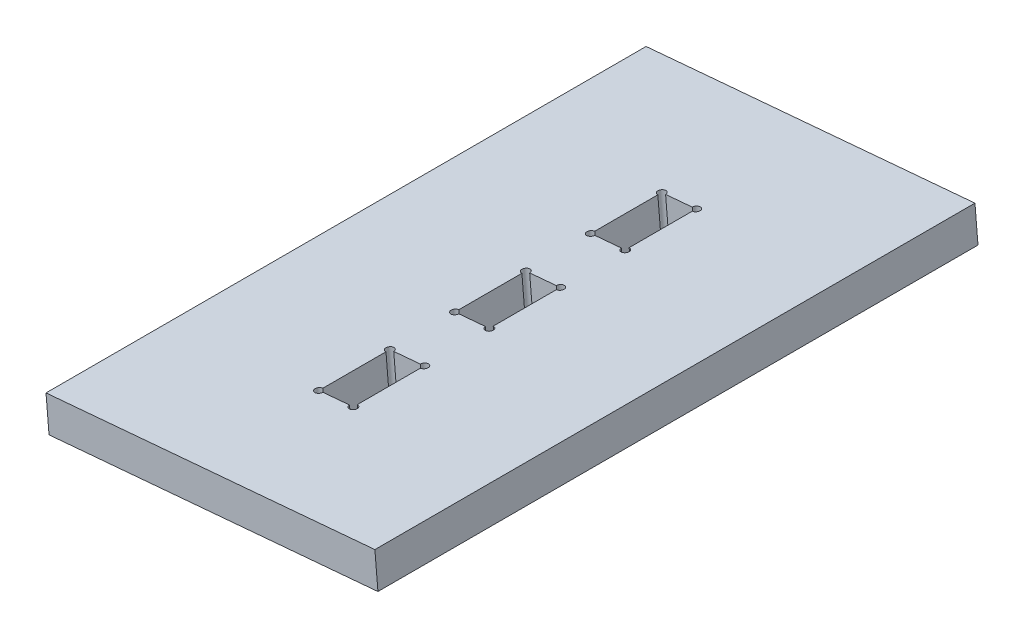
ISO-10303-21;
HEADER;
FILE_DESCRIPTION(('STEP AP214'),'2;1');
FILE_NAME('part.step','',(''),(''),'','','');
FILE_SCHEMA(('AUTOMOTIVE_DESIGN { 1 0 10303 214 1 1 1 1 }'));
ENDSEC;
DATA;
#1=APPLICATION_CONTEXT('core data for automotive mechanical design processes');
#2=APPLICATION_PROTOCOL_DEFINITION('international standard','automotive_design',2000,#1);
#3=PRODUCT_CONTEXT('',#1,'mechanical');
#4=PRODUCT('Part','Part','',(#3));
#5=PRODUCT_RELATED_PRODUCT_CATEGORY('part','',(#4));
#6=PRODUCT_DEFINITION_FORMATION('','',#4);
#7=PRODUCT_DEFINITION_CONTEXT('part definition',#1,'design');
#8=PRODUCT_DEFINITION('design','',#6,#7);
#9=PRODUCT_DEFINITION_SHAPE('','',#8);
#10=(LENGTH_UNIT() NAMED_UNIT(*) SI_UNIT(.MILLI.,.METRE.));
#11=(NAMED_UNIT(*) PLANE_ANGLE_UNIT() SI_UNIT($,.RADIAN.));
#12=(NAMED_UNIT(*) SI_UNIT($,.STERADIAN.) SOLID_ANGLE_UNIT());
#13=UNCERTAINTY_MEASURE_WITH_UNIT(LENGTH_MEASURE(1.E-05),#10,'distance_accuracy_value','');
#14=(GEOMETRIC_REPRESENTATION_CONTEXT(3) GLOBAL_UNCERTAINTY_ASSIGNED_CONTEXT((#13)) GLOBAL_UNIT_ASSIGNED_CONTEXT((#10,
#11,#12)) REPRESENTATION_CONTEXT('',''));
#15=CARTESIAN_POINT('',(0.,0.,0.));
#16=DIRECTION('',(0.,0.,1.));
#17=DIRECTION('',(1.,0.,0.));
#18=AXIS2_PLACEMENT_3D('',#15,#16,#17);
#19=CARTESIAN_POINT('',(138.934622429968,1.61861859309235,-182.268357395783));
#20=DIRECTION('',(0.,0.,-1.));
#21=DIRECTION('',(-1.,0.,0.));
#22=AXIS2_PLACEMENT_3D('',#19,#20,#21);
#23=PLANE('',#22);
#24=DIRECTION('',(-0.996194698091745,-0.0871557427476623,0.));
#25=VECTOR('',#24,1.);
#26=CARTESIAN_POINT('',(136.079297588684,34.2551308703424,-182.268357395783));
#27=LINE('',#26,#25);
#28=CARTESIAN_POINT('',(151.819173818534,35.6321916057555,-182.268357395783));
#29=VERTEX_POINT('',#28);
#30=CARTESIAN_POINT('',(138.071686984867,34.4294423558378,-182.268357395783));
#31=VERTEX_POINT('',#30);
#32=EDGE_CURVE('E11',#29,#31,#27,.T.);
#33=ORIENTED_EDGE('',*,*,#32,.T.);
#34=DIRECTION('',(-0.0871557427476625,0.996194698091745,0.));
#35=VECTOR('',#34,1.);
#36=CARTESIAN_POINT('',(140.927011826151,1.79293007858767,-182.268357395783));
#37=LINE('',#36,#35);
#38=CARTESIAN_POINT('',(139.640490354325,16.4979377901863,-182.268357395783));
#39=VERTEX_POINT('',#38);
#40=EDGE_CURVE('E415',#39,#31,#37,.T.);
#41=ORIENTED_EDGE('',*,*,#40,.F.);
#42=DIRECTION('',(0.996194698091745,0.0871557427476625,0.));
#43=VECTOR('',#42,1.);
#44=CARTESIAN_POINT('',(137.648100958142,16.323626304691,-182.268357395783));
#45=LINE('',#44,#43);
#46=CARTESIAN_POINT('',(153.387977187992,17.7006870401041,-182.268357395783));
#47=VERTEX_POINT('',#46);
#48=EDGE_CURVE('E407',#39,#47,#45,.T.);
#49=ORIENTED_EDGE('',*,*,#48,.T.);
#50=DIRECTION('',(-0.0871557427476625,0.996194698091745,0.));
#51=VECTOR('',#50,1.);
#52=CARTESIAN_POINT('',(154.674498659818,2.99567932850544,-182.268357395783));
#53=LINE('',#52,#51);
#54=EDGE_CURVE('E321',#29,#47,#53,.F.);
#55=ORIENTED_EDGE('',*,*,#54,.F.);
#56=EDGE_LOOP('',(#33,#41,#49,#55));
#57=FACE_BOUND('',#56,.T.);
#58=ADVANCED_FACE('F33',(#57),#23,.F.);
#59=CARTESIAN_POINT('',(138.934622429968,1.61861859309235,-182.268357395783));
#60=DIRECTION('',(-0.996194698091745,-0.0871557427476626,0.));
#61=DIRECTION('',(0.0871557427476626,-0.996194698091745,0.));
#62=AXIS2_PLACEMENT_3D('',#59,#60,#61);
#63=PLANE('',#62);
#64=DIRECTION('',(0.,0.,1.));
#65=VECTOR('',#64,1.);
#66=CARTESIAN_POINT('',(136.079297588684,34.2551308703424,-182.268357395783));
#67=LINE('',#66,#65);
#68=CARTESIAN_POINT('',(136.079297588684,34.2551308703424,-180.268357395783));
#69=VERTEX_POINT('',#68);
#70=CARTESIAN_POINT('',(136.079297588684,34.2551308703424,-147.768357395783));
#71=VERTEX_POINT('',#70);
#72=EDGE_CURVE('E40',#69,#71,#67,.T.);
#73=ORIENTED_EDGE('',*,*,#72,.T.);
#74=DIRECTION('',(-0.0871557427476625,0.996194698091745,0.));
#75=VECTOR('',#74,1.);
#76=CARTESIAN_POINT('',(138.934622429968,1.61861859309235,-147.768357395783));
#77=LINE('',#76,#75);
#78=CARTESIAN_POINT('',(137.648100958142,16.323626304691,-147.768357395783));
#79=VERTEX_POINT('',#78);
#80=EDGE_CURVE('E258',#79,#71,#77,.T.);
#81=ORIENTED_EDGE('',*,*,#80,.F.);
#82=DIRECTION('',(0.,0.,-1.));
#83=VECTOR('',#82,1.);
#84=CARTESIAN_POINT('',(137.648100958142,16.323626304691,-182.268357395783));
#85=LINE('',#84,#83);
#86=CARTESIAN_POINT('',(137.648100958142,16.323626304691,-180.268357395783));
#87=VERTEX_POINT('',#86);
#88=EDGE_CURVE('E249',#79,#87,#85,.T.);
#89=ORIENTED_EDGE('',*,*,#88,.T.);
#90=DIRECTION('',(-0.0871557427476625,0.996194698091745,0.));
#91=VECTOR('',#90,1.);
#92=CARTESIAN_POINT('',(138.934622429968,1.61861859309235,-180.268357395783));
#93=LINE('',#92,#91);
#94=EDGE_CURVE('E55',#69,#87,#93,.F.);
#95=ORIENTED_EDGE('',*,*,#94,.F.);
#96=EDGE_LOOP('',(#73,#81,#89,#95));
#97=FACE_BOUND('',#96,.T.);
#98=ADVANCED_FACE('F256',(#97),#63,.F.);
#99=CARTESIAN_POINT('',(156.666888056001,3.16999081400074,-145.768357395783));
#100=DIRECTION('',(0.,0.,1.));
#101=DIRECTION('',(1.,0.,0.));
#102=AXIS2_PLACEMENT_3D('',#99,#100,#101);
#103=PLANE('',#102);
#104=DIRECTION('',(0.996194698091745,0.0871557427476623,0.));
#105=VECTOR('',#104,1.);
#106=CARTESIAN_POINT('',(153.811563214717,35.8065030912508,-145.768357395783));
#107=LINE('',#106,#105);
#108=CARTESIAN_POINT('',(138.071686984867,34.4294423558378,-145.768357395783));
#109=VERTEX_POINT('',#108);
#110=CARTESIAN_POINT('',(151.819173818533,35.6321916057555,-145.768357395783));
#111=VERTEX_POINT('',#110);
#112=EDGE_CURVE('E244',#109,#111,#107,.T.);
#113=ORIENTED_EDGE('',*,*,#112,.T.);
#114=DIRECTION('',(-0.0871557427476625,0.996194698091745,0.));
#115=VECTOR('',#114,1.);
#116=CARTESIAN_POINT('',(154.674498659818,2.99567932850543,-145.768357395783));
#117=LINE('',#116,#115);
#118=CARTESIAN_POINT('',(153.387977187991,17.7006870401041,-145.768357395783));
#119=VERTEX_POINT('',#118);
#120=EDGE_CURVE('E222',#119,#111,#117,.T.);
#121=ORIENTED_EDGE('',*,*,#120,.F.);
#122=DIRECTION('',(-0.996194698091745,-0.0871557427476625,0.));
#123=VECTOR('',#122,1.);
#124=CARTESIAN_POINT('',(155.380366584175,17.8749985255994,-145.768357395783));
#125=LINE('',#124,#123);
#126=CARTESIAN_POINT('',(139.640490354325,16.4979377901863,-145.768357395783));
#127=VERTEX_POINT('',#126);
#128=EDGE_CURVE('E245',#119,#127,#125,.T.);
#129=ORIENTED_EDGE('',*,*,#128,.T.);
#130=DIRECTION('',(-0.0871557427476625,0.996194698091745,0.));
#131=VECTOR('',#130,1.);
#132=CARTESIAN_POINT('',(140.927011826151,1.79293007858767,-145.768357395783));
#133=LINE('',#132,#131);
#134=EDGE_CURVE('E47',#109,#127,#133,.F.);
#135=ORIENTED_EDGE('',*,*,#134,.F.);
#136=EDGE_LOOP('',(#113,#121,#129,#135));
#137=FACE_BOUND('',#136,.T.);
#138=ADVANCED_FACE('F441',(#137),#103,.F.);
#139=CARTESIAN_POINT('',(156.666888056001,3.16999081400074,-182.268357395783));
#140=DIRECTION('',(0.996194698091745,0.0871557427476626,0.));
#141=DIRECTION('',(-0.0871557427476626,0.996194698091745,0.));
#142=AXIS2_PLACEMENT_3D('',#139,#140,#141);
#143=PLANE('',#142);
#144=DIRECTION('',(0.,0.,1.));
#145=VECTOR('',#144,1.);
#146=CARTESIAN_POINT('',(155.380366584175,17.8749985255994,-182.268357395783));
#147=LINE('',#146,#145);
#148=CARTESIAN_POINT('',(155.380366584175,17.8749985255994,-180.268357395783));
#149=VERTEX_POINT('',#148);
#150=CARTESIAN_POINT('',(155.380366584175,17.8749985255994,-147.768357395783));
#151=VERTEX_POINT('',#150);
#152=EDGE_CURVE('E236',#149,#151,#147,.T.);
#153=ORIENTED_EDGE('',*,*,#152,.T.);
#154=DIRECTION('',(-0.0871557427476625,0.996194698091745,0.));
#155=VECTOR('',#154,1.);
#156=CARTESIAN_POINT('',(156.666888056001,3.16999081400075,-147.768357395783));
#157=LINE('',#156,#155);
#158=CARTESIAN_POINT('',(153.811563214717,35.8065030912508,-147.768357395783));
#159=VERTEX_POINT('',#158);
#160=EDGE_CURVE('E219',#159,#151,#157,.F.);
#161=ORIENTED_EDGE('',*,*,#160,.F.);
#162=DIRECTION('',(0.,0.,-1.));
#163=VECTOR('',#162,1.);
#164=CARTESIAN_POINT('',(153.811563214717,35.8065030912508,-182.268357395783));
#165=LINE('',#164,#163);
#166=CARTESIAN_POINT('',(153.811563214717,35.8065030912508,-180.268357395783));
#167=VERTEX_POINT('',#166);
#168=EDGE_CURVE('E233',#159,#167,#165,.T.);
#169=ORIENTED_EDGE('',*,*,#168,.T.);
#170=DIRECTION('',(-0.0871557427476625,0.996194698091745,0.));
#171=VECTOR('',#170,1.);
#172=CARTESIAN_POINT('',(156.666888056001,3.16999081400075,-180.268357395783));
#173=LINE('',#172,#171);
#174=EDGE_CURVE('E319',#149,#167,#173,.T.);
#175=ORIENTED_EDGE('',*,*,#174,.F.);
#176=EDGE_LOOP('',(#153,#161,#169,#175));
#177=FACE_BOUND('',#176,.T.);
#178=ADVANCED_FACE('F231',(#177),#143,.F.);
#179=CARTESIAN_POINT('',(229.621979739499,42.4390551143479,58.9816426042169));
#180=DIRECTION('',(-0.996194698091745,-0.0871557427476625,0.));
#181=DIRECTION('',(0.0871557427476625,-0.996194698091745,0.));
#182=AXIS2_PLACEMENT_3D('',#179,#180,#181);
#183=PLANE('',#182);
#184=DIRECTION('',(0.,0.,-1.));
#185=VECTOR('',#184,1.);
#186=CARTESIAN_POINT('',(231.190783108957,24.5075505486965,58.9816426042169));
#187=LINE('',#186,#185);
#188=CARTESIAN_POINT('',(231.190783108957,24.5075505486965,58.9816426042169));
#189=VERTEX_POINT('',#188);
#190=CARTESIAN_POINT('',(231.190783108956,24.5075505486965,-250.018357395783));
#191=VERTEX_POINT('',#190);
#192=EDGE_CURVE('E376',#189,#191,#187,.T.);
#193=ORIENTED_EDGE('',*,*,#192,.T.);
#194=DIRECTION('',(0.0871557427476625,-0.996194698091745,0.));
#195=VECTOR('',#194,1.);
#196=CARTESIAN_POINT('',(229.621979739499,42.4390551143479,-250.018357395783));
#197=LINE('',#196,#195);
#198=CARTESIAN_POINT('',(229.621979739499,42.4390551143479,-250.018357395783));
#199=VERTEX_POINT('',#198);
#200=EDGE_CURVE('E403',#199,#191,#197,.T.);
#201=ORIENTED_EDGE('',*,*,#200,.F.);
#202=DIRECTION('',(0.,0.,-1.));
#203=VECTOR('',#202,1.);
#204=CARTESIAN_POINT('',(229.621979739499,42.4390551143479,58.9816426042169));
#205=LINE('',#204,#203);
#206=CARTESIAN_POINT('',(229.621979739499,42.4390551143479,58.9816426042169));
#207=VERTEX_POINT('',#206);
#208=EDGE_CURVE('E377',#207,#199,#205,.T.);
#209=ORIENTED_EDGE('',*,*,#208,.F.);
#210=DIRECTION('',(0.0871557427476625,-0.996194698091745,0.));
#211=VECTOR('',#210,1.);
#212=CARTESIAN_POINT('',(229.621979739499,42.4390551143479,58.9816426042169));
#213=LINE('',#212,#211);
#214=EDGE_CURVE('E387',#207,#189,#213,.T.);
#215=ORIENTED_EDGE('',*,*,#214,.T.);
#216=EDGE_LOOP('',(#193,#201,#209,#215));
#217=FACE_BOUND('',#216,.T.);
#218=ADVANCED_FACE('F448',(#217),#183,.F.);
#219=CARTESIAN_POINT('',(229.621979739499,42.4390551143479,-250.018357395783));
#220=DIRECTION('',(0.,0.,1.));
#221=DIRECTION('',(1.,0.,0.));
#222=AXIS2_PLACEMENT_3D('',#219,#220,#221);
#223=PLANE('',#222);
#224=DIRECTION('',(-0.996194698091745,-0.0871557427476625,0.));
#225=VECTOR('',#224,1.);
#226=CARTESIAN_POINT('',(231.190783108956,24.5075505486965,-250.018357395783));
#227=LINE('',#226,#225);
#228=CARTESIAN_POINT('',(61.8376844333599,9.6910742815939,-250.018357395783));
#229=VERTEX_POINT('',#228);
#230=EDGE_CURVE('E390',#191,#229,#227,.T.);
#231=ORIENTED_EDGE('',*,*,#230,.T.);
#232=DIRECTION('',(0.0871557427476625,-0.996194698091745,0.));
#233=VECTOR('',#232,1.);
#234=CARTESIAN_POINT('',(60.2688810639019,27.6225788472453,-250.018357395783));
#235=LINE('',#234,#233);
#236=CARTESIAN_POINT('',(60.2688810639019,27.6225788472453,-250.018357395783));
#237=VERTEX_POINT('',#236);
#238=EDGE_CURVE('E400',#237,#229,#235,.T.);
#239=ORIENTED_EDGE('',*,*,#238,.F.);
#240=DIRECTION('',(-0.996194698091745,-0.0871557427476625,0.));
#241=VECTOR('',#240,1.);
#242=CARTESIAN_POINT('',(229.621979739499,42.4390551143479,-250.018357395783));
#243=LINE('',#242,#241);
#244=EDGE_CURVE('E380',#199,#237,#243,.T.);
#245=ORIENTED_EDGE('',*,*,#244,.F.);
#246=ORIENTED_EDGE('',*,*,#200,.T.);
#247=EDGE_LOOP('',(#231,#239,#245,#246));
#248=FACE_BOUND('',#247,.T.);
#249=ADVANCED_FACE('F693',(#248),#223,.F.);
#250=CARTESIAN_POINT('',(60.268881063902,27.6225788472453,58.9816426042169));
#251=DIRECTION('',(0.996194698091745,0.0871557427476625,0.));
#252=DIRECTION('',(-0.0871557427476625,0.996194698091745,0.));
#253=AXIS2_PLACEMENT_3D('',#250,#251,#252);
#254=PLANE('',#253);
#255=DIRECTION('',(0.,0.,1.));
#256=VECTOR('',#255,1.);
#257=CARTESIAN_POINT('',(61.8376844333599,9.6910742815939,58.9816426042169));
#258=LINE('',#257,#256);
#259=CARTESIAN_POINT('',(61.8376844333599,9.6910742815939,58.9816426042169));
#260=VERTEX_POINT('',#259);
#261=EDGE_CURVE('E392',#229,#260,#258,.T.);
#262=ORIENTED_EDGE('',*,*,#261,.T.);
#263=DIRECTION('',(0.0871557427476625,-0.996194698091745,0.));
#264=VECTOR('',#263,1.);
#265=CARTESIAN_POINT('',(60.268881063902,27.6225788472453,58.9816426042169));
#266=LINE('',#265,#264);
#267=CARTESIAN_POINT('',(60.268881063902,27.6225788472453,58.9816426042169));
#268=VERTEX_POINT('',#267);
#269=EDGE_CURVE('E397',#268,#260,#266,.T.);
#270=ORIENTED_EDGE('',*,*,#269,.F.);
#271=DIRECTION('',(0.,0.,1.));
#272=VECTOR('',#271,1.);
#273=CARTESIAN_POINT('',(60.268881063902,27.6225788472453,58.9816426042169));
#274=LINE('',#273,#272);
#275=EDGE_CURVE('E383',#237,#268,#274,.T.);
#276=ORIENTED_EDGE('',*,*,#275,.F.);
#277=ORIENTED_EDGE('',*,*,#238,.T.);
#278=EDGE_LOOP('',(#262,#270,#276,#277));
#279=FACE_BOUND('',#278,.T.);
#280=ADVANCED_FACE('F689',(#279),#254,.F.);
#281=CARTESIAN_POINT('',(60.268881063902,27.6225788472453,58.9816426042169));
#282=DIRECTION('',(0.,0.,-1.));
#283=DIRECTION('',(-1.,0.,0.));
#284=AXIS2_PLACEMENT_3D('',#281,#282,#283);
#285=PLANE('',#284);
#286=DIRECTION('',(0.996194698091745,0.0871557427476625,0.));
#287=VECTOR('',#286,1.);
#288=CARTESIAN_POINT('',(61.8376844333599,9.6910742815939,58.9816426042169));
#289=LINE('',#288,#287);
#290=EDGE_CURVE('E381',#260,#189,#289,.T.);
#291=ORIENTED_EDGE('',*,*,#290,.T.);
#292=ORIENTED_EDGE('',*,*,#214,.F.);
#293=DIRECTION('',(0.996194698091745,0.0871557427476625,0.));
#294=VECTOR('',#293,1.);
#295=CARTESIAN_POINT('',(60.268881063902,27.6225788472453,58.9816426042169));
#296=LINE('',#295,#294);
#297=EDGE_CURVE('E385',#268,#207,#296,.T.);
#298=ORIENTED_EDGE('',*,*,#297,.F.);
#299=ORIENTED_EDGE('',*,*,#269,.T.);
#300=EDGE_LOOP('',(#291,#292,#298,#299));
#301=FACE_BOUND('',#300,.T.);
#302=ADVANCED_FACE('F479',(#301),#285,.F.);
#303=CARTESIAN_POINT('',(-1.94049537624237,22.1799636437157,0.));
#304=DIRECTION('',(-0.0871557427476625,0.996194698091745,0.));
#305=DIRECTION('',(-0.996194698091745,-0.0871557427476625,0.));
#306=AXIS2_PLACEMENT_3D('',#303,#304,#305);
#307=PLANE('',#306);
#308=CARTESIAN_POINT('',(136.079297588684,34.2551308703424,-112.268357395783));
#309=DIRECTION('',(-0.0871557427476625,0.996194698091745,0.));
#310=DIRECTION('',(-0.996194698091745,-0.0871557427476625,0.));
#311=AXIS2_PLACEMENT_3D('',#308,#309,#310);
#312=CIRCLE('',#311,1.99999999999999);
#313=CARTESIAN_POINT('',(138.071686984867,34.4294423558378,-112.268357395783));
#314=VERTEX_POINT('',#313);
#315=CARTESIAN_POINT('',(136.079297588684,34.2551308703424,-110.268357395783));
#316=VERTEX_POINT('',#315);
#317=EDGE_CURVE('E432',#314,#316,#312,.T.);
#318=ORIENTED_EDGE('',*,*,#317,.F.);
#319=DIRECTION('',(-0.996194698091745,-0.0871557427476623,0.));
#320=VECTOR('',#319,1.);
#321=CARTESIAN_POINT('',(136.079297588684,34.2551308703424,-112.268357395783));
#322=LINE('',#321,#320);
#323=CARTESIAN_POINT('',(151.819173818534,35.6321916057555,-112.268357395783));
#324=VERTEX_POINT('',#323);
#325=EDGE_CURVE('E331',#324,#314,#322,.T.);
#326=ORIENTED_EDGE('',*,*,#325,.F.);
#327=CARTESIAN_POINT('',(153.811563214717,35.8065030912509,-112.268357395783));
#328=DIRECTION('',(-0.0871557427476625,0.996194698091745,0.));
#329=DIRECTION('',(-0.996194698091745,-0.0871557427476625,0.));
#330=AXIS2_PLACEMENT_3D('',#327,#328,#329);
#331=CIRCLE('',#330,1.99999999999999);
#332=CARTESIAN_POINT('',(153.811563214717,35.8065030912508,-110.268357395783));
#333=VERTEX_POINT('',#332);
#334=EDGE_CURVE('E426',#333,#324,#331,.T.);
#335=ORIENTED_EDGE('',*,*,#334,.F.);
#336=DIRECTION('',(0.,0.,-1.));
#337=VECTOR('',#336,1.);
#338=CARTESIAN_POINT('',(153.811563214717,35.8065030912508,-112.268357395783));
#339=LINE('',#338,#337);
#340=CARTESIAN_POINT('',(153.811563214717,35.8065030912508,-77.7683573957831));
#341=VERTEX_POINT('',#340);
#342=EDGE_CURVE('E349',#341,#333,#339,.T.);
#343=ORIENTED_EDGE('',*,*,#342,.F.);
#344=CARTESIAN_POINT('',(153.811563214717,35.8065030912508,-75.7683573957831));
#345=DIRECTION('',(-0.0871557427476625,0.996194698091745,0.));
#346=DIRECTION('',(-0.996194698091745,-0.0871557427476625,0.));
#347=AXIS2_PLACEMENT_3D('',#344,#345,#346);
#348=CIRCLE('',#347,1.99999999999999);
#349=CARTESIAN_POINT('',(151.819173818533,35.6321916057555,-75.7683573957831));
#350=VERTEX_POINT('',#349);
#351=EDGE_CURVE('E310',#350,#341,#348,.T.);
#352=ORIENTED_EDGE('',*,*,#351,.F.);
#353=DIRECTION('',(0.996194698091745,0.0871557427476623,0.));
#354=VECTOR('',#353,1.);
#355=CARTESIAN_POINT('',(153.811563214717,35.8065030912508,-75.7683573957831));
#356=LINE('',#355,#354);
#357=CARTESIAN_POINT('',(138.071686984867,34.4294423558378,-75.7683573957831));
#358=VERTEX_POINT('',#357);
#359=EDGE_CURVE('E343',#358,#350,#356,.T.);
#360=ORIENTED_EDGE('',*,*,#359,.F.);
#361=CARTESIAN_POINT('',(136.079297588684,34.2551308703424,-75.7683573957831));
#362=DIRECTION('',(-0.0871557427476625,0.996194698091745,0.));
#363=DIRECTION('',(-0.996194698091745,-0.0871557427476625,0.));
#364=AXIS2_PLACEMENT_3D('',#361,#362,#363);
#365=CIRCLE('',#364,1.99999999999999);
#366=CARTESIAN_POINT('',(136.079297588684,34.2551308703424,-77.768357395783));
#367=VERTEX_POINT('',#366);
#368=EDGE_CURVE('E300',#367,#358,#365,.T.);
#369=ORIENTED_EDGE('',*,*,#368,.F.);
#370=DIRECTION('',(0.,0.,1.));
#371=VECTOR('',#370,1.);
#372=CARTESIAN_POINT('',(136.079297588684,34.2551308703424,-112.268357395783));
#373=LINE('',#372,#371);
#374=EDGE_CURVE('E337',#316,#367,#373,.T.);
#375=ORIENTED_EDGE('',*,*,#374,.F.);
#376=EDGE_LOOP('',(#318,#326,#335,#343,#352,#360,#369,#375));
#377=FACE_BOUND('',#376,.T.);
#378=CARTESIAN_POINT('',(153.811563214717,35.8065030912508,-145.768357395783));
#379=DIRECTION('',(-0.0871557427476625,0.996194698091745,0.));
#380=DIRECTION('',(-0.996194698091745,-0.0871557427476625,0.));
#381=AXIS2_PLACEMENT_3D('',#378,#379,#380);
#382=CIRCLE('',#381,1.99999999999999);
#383=EDGE_CURVE('E216',#111,#159,#382,.T.);
#384=ORIENTED_EDGE('',*,*,#383,.F.);
#385=ORIENTED_EDGE('',*,*,#112,.F.);
#386=CARTESIAN_POINT('',(136.079297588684,34.2551308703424,-145.768357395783));
#387=DIRECTION('',(-0.0871557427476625,0.996194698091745,0.));
#388=DIRECTION('',(-0.996194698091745,-0.0871557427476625,0.));
#389=AXIS2_PLACEMENT_3D('',#386,#387,#388);
#390=CIRCLE('',#389,1.99999999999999);
#391=EDGE_CURVE('E263',#71,#109,#390,.T.);
#392=ORIENTED_EDGE('',*,*,#391,.F.);
#393=ORIENTED_EDGE('',*,*,#72,.F.);
#394=CARTESIAN_POINT('',(136.079297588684,34.2551308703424,-182.268357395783));
#395=DIRECTION('',(-0.0871557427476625,0.996194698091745,0.));
#396=DIRECTION('',(-0.996194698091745,-0.0871557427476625,0.));
#397=AXIS2_PLACEMENT_3D('',#394,#395,#396);
#398=CIRCLE('',#397,1.99999999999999);
#399=EDGE_CURVE('E262',#31,#69,#398,.T.);
#400=ORIENTED_EDGE('',*,*,#399,.F.);
#401=ORIENTED_EDGE('',*,*,#32,.F.);
#402=CARTESIAN_POINT('',(153.811563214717,35.8065030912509,-182.268357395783));
#403=DIRECTION('',(-0.0871557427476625,0.996194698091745,0.));
#404=DIRECTION('',(-0.996194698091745,-0.0871557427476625,0.));
#405=AXIS2_PLACEMENT_3D('',#402,#403,#404);
#406=CIRCLE('',#405,1.99999999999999);
#407=EDGE_CURVE('E243',#167,#29,#406,.T.);
#408=ORIENTED_EDGE('',*,*,#407,.F.);
#409=ORIENTED_EDGE('',*,*,#168,.F.);
#410=EDGE_LOOP('',(#384,#385,#392,#393,#400,#401,#408,#409));
#411=FACE_BOUND('',#410,.T.);
#412=CARTESIAN_POINT('',(153.811563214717,35.8065030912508,-5.76835739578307));
#413=DIRECTION('',(-0.0871557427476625,0.996194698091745,0.));
#414=DIRECTION('',(-0.996194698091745,-0.0871557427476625,0.));
#415=AXIS2_PLACEMENT_3D('',#412,#413,#414);
#416=CIRCLE('',#415,1.99999999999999);
#417=CARTESIAN_POINT('',(151.819173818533,35.6321916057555,-5.76835739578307));
#418=VERTEX_POINT('',#417);
#419=CARTESIAN_POINT('',(153.811563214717,35.8065030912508,-7.76835739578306));
#420=VERTEX_POINT('',#419);
#421=EDGE_CURVE('E292',#418,#420,#416,.T.);
#422=ORIENTED_EDGE('',*,*,#421,.F.);
#423=DIRECTION('',(0.996194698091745,0.0871557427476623,0.));
#424=VECTOR('',#423,1.);
#425=CARTESIAN_POINT('',(153.811563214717,35.8065030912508,-5.76835739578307));
#426=LINE('',#425,#424);
#427=CARTESIAN_POINT('',(138.071686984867,34.4294423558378,-5.76835739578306));
#428=VERTEX_POINT('',#427);
#429=EDGE_CURVE('E370',#428,#418,#426,.T.);
#430=ORIENTED_EDGE('',*,*,#429,.F.);
#431=CARTESIAN_POINT('',(136.079297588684,34.2551308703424,-5.76835739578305));
#432=DIRECTION('',(-0.0871557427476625,0.996194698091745,0.));
#433=DIRECTION('',(-0.996194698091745,-0.0871557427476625,0.));
#434=AXIS2_PLACEMENT_3D('',#431,#432,#433);
#435=CIRCLE('',#434,1.99999999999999);
#436=CARTESIAN_POINT('',(136.079297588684,34.2551308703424,-7.76835739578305));
#437=VERTEX_POINT('',#436);
#438=EDGE_CURVE('E285',#437,#428,#435,.T.);
#439=ORIENTED_EDGE('',*,*,#438,.F.);
#440=DIRECTION('',(0.,0.,1.));
#441=VECTOR('',#440,1.);
#442=CARTESIAN_POINT('',(136.079297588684,34.2551308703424,-42.2683573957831));
#443=LINE('',#442,#441);
#444=CARTESIAN_POINT('',(136.079297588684,34.2551308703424,-40.2683573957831));
#445=VERTEX_POINT('',#444);
#446=EDGE_CURVE('E367',#445,#437,#443,.T.);
#447=ORIENTED_EDGE('',*,*,#446,.F.);
#448=CARTESIAN_POINT('',(136.079297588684,34.2551308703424,-42.2683573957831));
#449=DIRECTION('',(-0.0871557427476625,0.996194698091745,0.));
#450=DIRECTION('',(-0.996194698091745,-0.0871557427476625,0.));
#451=AXIS2_PLACEMENT_3D('',#448,#449,#450);
#452=CIRCLE('',#451,1.99999999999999);
#453=CARTESIAN_POINT('',(138.071686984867,34.4294423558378,-42.2683573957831));
#454=VERTEX_POINT('',#453);
#455=EDGE_CURVE('E275',#454,#445,#452,.T.);
#456=ORIENTED_EDGE('',*,*,#455,.F.);
#457=DIRECTION('',(-0.996194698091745,-0.0871557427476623,0.));
#458=VECTOR('',#457,1.);
#459=CARTESIAN_POINT('',(136.079297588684,34.2551308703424,-42.2683573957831));
#460=LINE('',#459,#458);
#461=CARTESIAN_POINT('',(151.819173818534,35.6321916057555,-42.2683573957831));
#462=VERTEX_POINT('',#461);
#463=EDGE_CURVE('E364',#462,#454,#460,.T.);
#464=ORIENTED_EDGE('',*,*,#463,.F.);
#465=CARTESIAN_POINT('',(153.811563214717,35.8065030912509,-42.2683573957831));
#466=DIRECTION('',(-0.0871557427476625,0.996194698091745,0.));
#467=DIRECTION('',(-0.996194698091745,-0.0871557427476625,0.));
#468=AXIS2_PLACEMENT_3D('',#465,#466,#467);
#469=CIRCLE('',#468,1.99999999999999);
#470=CARTESIAN_POINT('',(153.811563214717,35.8065030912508,-40.2683573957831));
#471=VERTEX_POINT('',#470);
#472=EDGE_CURVE('E316',#471,#462,#469,.T.);
#473=ORIENTED_EDGE('',*,*,#472,.F.);
#474=DIRECTION('',(0.,0.,-1.));
#475=VECTOR('',#474,1.);
#476=CARTESIAN_POINT('',(153.811563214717,35.8065030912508,-42.2683573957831));
#477=LINE('',#476,#475);
#478=EDGE_CURVE('E361',#420,#471,#477,.T.);
#479=ORIENTED_EDGE('',*,*,#478,.F.);
#480=EDGE_LOOP('',(#422,#430,#439,#447,#456,#464,#473,#479));
#481=FACE_BOUND('',#480,.T.);
#482=ORIENTED_EDGE('',*,*,#208,.T.);
#483=ORIENTED_EDGE('',*,*,#244,.T.);
#484=ORIENTED_EDGE('',*,*,#275,.T.);
#485=ORIENTED_EDGE('',*,*,#297,.T.);
#486=EDGE_LOOP('',(#482,#483,#484,#485));
#487=FACE_BOUND('',#486,.T.);
#488=ADVANCED_FACE('F240',(#377,#411,#481,#487),#307,.T.);
#489=CARTESIAN_POINT('',(-0.371692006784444,4.2484590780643,0.));
#490=DIRECTION('',(-0.0871557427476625,0.996194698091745,0.));
#491=DIRECTION('',(-0.996194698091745,-0.0871557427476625,0.));
#492=AXIS2_PLACEMENT_3D('',#489,#490,#491);
#493=PLANE('',#492);
#494=DIRECTION('',(0.996194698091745,0.0871557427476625,0.));
#495=VECTOR('',#494,1.);
#496=CARTESIAN_POINT('',(137.648100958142,16.323626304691,-112.268357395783));
#497=LINE('',#496,#495);
#498=CARTESIAN_POINT('',(139.640490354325,16.4979377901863,-112.268357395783));
#499=VERTEX_POINT('',#498);
#500=CARTESIAN_POINT('',(153.387977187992,17.7006870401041,-112.268357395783));
#501=VERTEX_POINT('',#500);
#502=EDGE_CURVE('E328',#499,#501,#497,.T.);
#503=ORIENTED_EDGE('',*,*,#502,.F.);
#504=CARTESIAN_POINT('',(137.648100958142,16.323626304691,-112.268357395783));
#505=DIRECTION('',(-0.0871557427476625,0.996194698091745,0.));
#506=DIRECTION('',(-0.996194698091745,-0.0871557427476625,0.));
#507=AXIS2_PLACEMENT_3D('',#504,#505,#506);
#508=CIRCLE('',#507,1.99999999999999);
#509=CARTESIAN_POINT('',(137.648100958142,16.323626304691,-110.268357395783));
#510=VERTEX_POINT('',#509);
#511=EDGE_CURVE('E424',#510,#499,#508,.F.);
#512=ORIENTED_EDGE('',*,*,#511,.F.);
#513=DIRECTION('',(0.,0.,-1.));
#514=VECTOR('',#513,1.);
#515=CARTESIAN_POINT('',(137.648100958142,16.323626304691,-112.268357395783));
#516=LINE('',#515,#514);
#517=CARTESIAN_POINT('',(137.648100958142,16.323626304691,-77.768357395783));
#518=VERTEX_POINT('',#517);
#519=EDGE_CURVE('E334',#518,#510,#516,.T.);
#520=ORIENTED_EDGE('',*,*,#519,.F.);
#521=CARTESIAN_POINT('',(137.648100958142,16.323626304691,-75.7683573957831));
#522=DIRECTION('',(-0.0871557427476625,0.996194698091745,0.));
#523=DIRECTION('',(-0.996194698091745,-0.0871557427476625,0.));
#524=AXIS2_PLACEMENT_3D('',#521,#522,#523);
#525=CIRCLE('',#524,1.99999999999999);
#526=CARTESIAN_POINT('',(139.640490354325,16.4979377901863,-75.7683573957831));
#527=VERTEX_POINT('',#526);
#528=EDGE_CURVE('E302',#527,#518,#525,.F.);
#529=ORIENTED_EDGE('',*,*,#528,.F.);
#530=DIRECTION('',(-0.996194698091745,-0.0871557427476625,0.));
#531=VECTOR('',#530,1.);
#532=CARTESIAN_POINT('',(155.380366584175,17.8749985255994,-75.7683573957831));
#533=LINE('',#532,#531);
#534=CARTESIAN_POINT('',(153.387977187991,17.7006870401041,-75.7683573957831));
#535=VERTEX_POINT('',#534);
#536=EDGE_CURVE('E340',#535,#527,#533,.T.);
#537=ORIENTED_EDGE('',*,*,#536,.F.);
#538=CARTESIAN_POINT('',(155.380366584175,17.8749985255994,-75.7683573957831));
#539=DIRECTION('',(-0.0871557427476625,0.996194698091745,0.));
#540=DIRECTION('',(-0.996194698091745,-0.0871557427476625,0.));
#541=AXIS2_PLACEMENT_3D('',#538,#539,#540);
#542=CIRCLE('',#541,1.99999999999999);
#543=CARTESIAN_POINT('',(155.380366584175,17.8749985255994,-77.7683573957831));
#544=VERTEX_POINT('',#543);
#545=EDGE_CURVE('E298',#544,#535,#542,.F.);
#546=ORIENTED_EDGE('',*,*,#545,.F.);
#547=DIRECTION('',(0.,0.,1.));
#548=VECTOR('',#547,1.);
#549=CARTESIAN_POINT('',(155.380366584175,17.8749985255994,-112.268357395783));
#550=LINE('',#549,#548);
#551=CARTESIAN_POINT('',(155.380366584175,17.8749985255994,-110.268357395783));
#552=VERTEX_POINT('',#551);
#553=EDGE_CURVE('E346',#552,#544,#550,.T.);
#554=ORIENTED_EDGE('',*,*,#553,.F.);
#555=CARTESIAN_POINT('',(155.380366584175,17.8749985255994,-112.268357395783));
#556=DIRECTION('',(-0.0871557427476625,0.996194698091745,0.));
#557=DIRECTION('',(-0.996194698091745,-0.0871557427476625,0.));
#558=AXIS2_PLACEMENT_3D('',#555,#556,#557);
#559=CIRCLE('',#558,1.99999999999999);
#560=EDGE_CURVE('E237',#501,#552,#559,.F.);
#561=ORIENTED_EDGE('',*,*,#560,.F.);
#562=EDGE_LOOP('',(#503,#512,#520,#529,#537,#546,#554,#561));
#563=FACE_BOUND('',#562,.T.);
#564=DIRECTION('',(-0.996194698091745,-0.0871557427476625,0.));
#565=VECTOR('',#564,1.);
#566=CARTESIAN_POINT('',(155.380366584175,17.8749985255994,-5.76835739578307));
#567=LINE('',#566,#565);
#568=CARTESIAN_POINT('',(153.387977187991,17.7006870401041,-5.76835739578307));
#569=VERTEX_POINT('',#568);
#570=CARTESIAN_POINT('',(139.640490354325,16.4979377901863,-5.76835739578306));
#571=VERTEX_POINT('',#570);
#572=EDGE_CURVE('E355',#569,#571,#567,.T.);
#573=ORIENTED_EDGE('',*,*,#572,.F.);
#574=CARTESIAN_POINT('',(155.380366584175,17.8749985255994,-5.76835739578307));
#575=DIRECTION('',(-0.0871557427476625,0.996194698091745,0.));
#576=DIRECTION('',(-0.996194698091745,-0.0871557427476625,0.));
#577=AXIS2_PLACEMENT_3D('',#574,#575,#576);
#578=CIRCLE('',#577,1.99999999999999);
#579=CARTESIAN_POINT('',(155.380366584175,17.8749985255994,-7.76835739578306));
#580=VERTEX_POINT('',#579);
#581=EDGE_CURVE('E283',#580,#569,#578,.F.);
#582=ORIENTED_EDGE('',*,*,#581,.F.);
#583=DIRECTION('',(0.,0.,1.));
#584=VECTOR('',#583,1.);
#585=CARTESIAN_POINT('',(155.380366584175,17.8749985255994,-42.2683573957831));
#586=LINE('',#585,#584);
#587=CARTESIAN_POINT('',(155.380366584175,17.8749985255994,-40.2683573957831));
#588=VERTEX_POINT('',#587);
#589=EDGE_CURVE('E358',#588,#580,#586,.T.);
#590=ORIENTED_EDGE('',*,*,#589,.F.);
#591=CARTESIAN_POINT('',(155.380366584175,17.8749985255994,-42.2683573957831));
#592=DIRECTION('',(-0.0871557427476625,0.996194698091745,0.));
#593=DIRECTION('',(-0.996194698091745,-0.0871557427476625,0.));
#594=AXIS2_PLACEMENT_3D('',#591,#592,#593);
#595=CIRCLE('',#594,1.99999999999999);
#596=CARTESIAN_POINT('',(153.387977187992,17.7006870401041,-42.2683573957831));
#597=VERTEX_POINT('',#596);
#598=EDGE_CURVE('E308',#597,#588,#595,.F.);
#599=ORIENTED_EDGE('',*,*,#598,.F.);
#600=DIRECTION('',(0.996194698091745,0.0871557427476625,0.));
#601=VECTOR('',#600,1.);
#602=CARTESIAN_POINT('',(137.648100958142,16.323626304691,-42.2683573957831));
#603=LINE('',#602,#601);
#604=CARTESIAN_POINT('',(139.640490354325,16.4979377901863,-42.2683573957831));
#605=VERTEX_POINT('',#604);
#606=EDGE_CURVE('E373',#605,#597,#603,.T.);
#607=ORIENTED_EDGE('',*,*,#606,.F.);
#608=CARTESIAN_POINT('',(137.648100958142,16.323626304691,-42.2683573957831));
#609=DIRECTION('',(-0.0871557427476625,0.996194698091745,0.));
#610=DIRECTION('',(-0.996194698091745,-0.0871557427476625,0.));
#611=AXIS2_PLACEMENT_3D('',#608,#609,#610);
#612=CIRCLE('',#611,1.99999999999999);
#613=CARTESIAN_POINT('',(137.648100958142,16.323626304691,-40.2683573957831));
#614=VERTEX_POINT('',#613);
#615=EDGE_CURVE('E277',#614,#605,#612,.F.);
#616=ORIENTED_EDGE('',*,*,#615,.F.);
#617=DIRECTION('',(0.,0.,-1.));
#618=VECTOR('',#617,1.);
#619=CARTESIAN_POINT('',(137.648100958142,16.323626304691,-42.2683573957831));
#620=LINE('',#619,#618);
#621=CARTESIAN_POINT('',(137.648100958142,16.323626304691,-7.76835739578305));
#622=VERTEX_POINT('',#621);
#623=EDGE_CURVE('E352',#622,#614,#620,.T.);
#624=ORIENTED_EDGE('',*,*,#623,.F.);
#625=CARTESIAN_POINT('',(137.648100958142,16.323626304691,-5.76835739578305));
#626=DIRECTION('',(-0.0871557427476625,0.996194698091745,0.));
#627=DIRECTION('',(-0.996194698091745,-0.0871557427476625,0.));
#628=AXIS2_PLACEMENT_3D('',#625,#626,#627);
#629=CIRCLE('',#628,1.99999999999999);
#630=EDGE_CURVE('E273',#571,#622,#629,.F.);
#631=ORIENTED_EDGE('',*,*,#630,.F.);
#632=EDGE_LOOP('',(#573,#582,#590,#599,#607,#616,#624,#631));
#633=FACE_BOUND('',#632,.T.);
#634=ORIENTED_EDGE('',*,*,#192,.F.);
#635=ORIENTED_EDGE('',*,*,#290,.F.);
#636=ORIENTED_EDGE('',*,*,#261,.F.);
#637=ORIENTED_EDGE('',*,*,#230,.F.);
#638=EDGE_LOOP('',(#634,#635,#636,#637));
#639=FACE_BOUND('',#638,.T.);
#640=ORIENTED_EDGE('',*,*,#128,.F.);
#641=CARTESIAN_POINT('',(155.380366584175,17.8749985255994,-145.768357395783));
#642=DIRECTION('',(-0.0871557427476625,0.996194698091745,0.));
#643=DIRECTION('',(-0.996194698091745,-0.0871557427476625,0.));
#644=AXIS2_PLACEMENT_3D('',#641,#642,#643);
#645=CIRCLE('',#644,1.99999999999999);
#646=EDGE_CURVE('E227',#151,#119,#645,.F.);
#647=ORIENTED_EDGE('',*,*,#646,.F.);
#648=ORIENTED_EDGE('',*,*,#152,.F.);
#649=CARTESIAN_POINT('',(155.380366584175,17.8749985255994,-182.268357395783));
#650=DIRECTION('',(-0.0871557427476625,0.996194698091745,0.));
#651=DIRECTION('',(-0.996194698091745,-0.0871557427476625,0.));
#652=AXIS2_PLACEMENT_3D('',#649,#650,#651);
#653=CIRCLE('',#652,1.99999999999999);
#654=EDGE_CURVE('E326',#47,#149,#653,.F.);
#655=ORIENTED_EDGE('',*,*,#654,.F.);
#656=ORIENTED_EDGE('',*,*,#48,.F.);
#657=CARTESIAN_POINT('',(137.648100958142,16.323626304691,-182.268357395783));
#658=DIRECTION('',(-0.0871557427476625,0.996194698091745,0.));
#659=DIRECTION('',(-0.996194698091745,-0.0871557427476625,0.));
#660=AXIS2_PLACEMENT_3D('',#657,#658,#659);
#661=CIRCLE('',#660,1.99999999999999);
#662=EDGE_CURVE('E322',#87,#39,#661,.F.);
#663=ORIENTED_EDGE('',*,*,#662,.F.);
#664=ORIENTED_EDGE('',*,*,#88,.F.);
#665=CARTESIAN_POINT('',(137.648100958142,16.323626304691,-145.768357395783));
#666=DIRECTION('',(-0.0871557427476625,0.996194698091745,0.));
#667=DIRECTION('',(-0.996194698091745,-0.0871557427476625,0.));
#668=AXIS2_PLACEMENT_3D('',#665,#666,#667);
#669=CIRCLE('',#668,1.99999999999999);
#670=EDGE_CURVE('E264',#127,#79,#669,.F.);
#671=ORIENTED_EDGE('',*,*,#670,.F.);
#672=EDGE_LOOP('',(#640,#647,#648,#655,#656,#663,#664,#671));
#673=FACE_BOUND('',#672,.T.);
#674=ADVANCED_FACE('F410',(#563,#633,#639,#673),#493,.F.);
#675=CARTESIAN_POINT('',(156.666888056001,3.16999081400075,-42.2683573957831));
#676=DIRECTION('',(0.996194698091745,0.0871557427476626,0.));
#677=DIRECTION('',(-0.0871557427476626,0.996194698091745,0.));
#678=AXIS2_PLACEMENT_3D('',#675,#676,#677);
#679=PLANE('',#678);
#680=ORIENTED_EDGE('',*,*,#589,.T.);
#681=DIRECTION('',(-0.0871557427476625,0.996194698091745,0.));
#682=VECTOR('',#681,1.);
#683=CARTESIAN_POINT('',(156.666888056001,3.16999081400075,-7.76835739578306));
#684=LINE('',#683,#682);
#685=EDGE_CURVE('E290',#420,#580,#684,.F.);
#686=ORIENTED_EDGE('',*,*,#685,.F.);
#687=ORIENTED_EDGE('',*,*,#478,.T.);
#688=DIRECTION('',(-0.0871557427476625,0.996194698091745,0.));
#689=VECTOR('',#688,1.);
#690=CARTESIAN_POINT('',(156.666888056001,3.16999081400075,-40.2683573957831));
#691=LINE('',#690,#689);
#692=EDGE_CURVE('E314',#588,#471,#691,.T.);
#693=ORIENTED_EDGE('',*,*,#692,.F.);
#694=EDGE_LOOP('',(#680,#686,#687,#693));
#695=FACE_BOUND('',#694,.T.);
#696=ADVANCED_FACE('F491',(#695),#679,.F.);
#697=CARTESIAN_POINT('',(156.666888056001,3.16999081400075,-5.76835739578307));
#698=DIRECTION('',(0.,0.,1.));
#699=DIRECTION('',(1.,0.,0.));
#700=AXIS2_PLACEMENT_3D('',#697,#698,#699);
#701=PLANE('',#700);
#702=ORIENTED_EDGE('',*,*,#429,.T.);
#703=DIRECTION('',(-0.0871557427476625,0.996194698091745,0.));
#704=VECTOR('',#703,1.);
#705=CARTESIAN_POINT('',(154.674498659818,2.99567932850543,-5.76835739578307));
#706=LINE('',#705,#704);
#707=EDGE_CURVE('E288',#569,#418,#706,.T.);
#708=ORIENTED_EDGE('',*,*,#707,.F.);
#709=ORIENTED_EDGE('',*,*,#572,.T.);
#710=DIRECTION('',(-0.0871557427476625,0.996194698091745,0.));
#711=VECTOR('',#710,1.);
#712=CARTESIAN_POINT('',(140.927011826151,1.79293007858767,-5.76835739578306));
#713=LINE('',#712,#711);
#714=EDGE_CURVE('E282',#428,#571,#713,.F.);
#715=ORIENTED_EDGE('',*,*,#714,.F.);
#716=EDGE_LOOP('',(#702,#708,#709,#715));
#717=FACE_BOUND('',#716,.T.);
#718=ADVANCED_FACE('F501',(#717),#701,.F.);
#719=CARTESIAN_POINT('',(138.934622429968,1.61861859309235,-42.2683573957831));
#720=DIRECTION('',(-0.996194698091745,-0.0871557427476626,0.));
#721=DIRECTION('',(0.0871557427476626,-0.996194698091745,0.));
#722=AXIS2_PLACEMENT_3D('',#719,#720,#721);
#723=PLANE('',#722);
#724=ORIENTED_EDGE('',*,*,#446,.T.);
#725=DIRECTION('',(-0.0871557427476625,0.996194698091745,0.));
#726=VECTOR('',#725,1.);
#727=CARTESIAN_POINT('',(138.934622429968,1.61861859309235,-7.76835739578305));
#728=LINE('',#727,#726);
#729=EDGE_CURVE('E280',#622,#437,#728,.T.);
#730=ORIENTED_EDGE('',*,*,#729,.F.);
#731=ORIENTED_EDGE('',*,*,#623,.T.);
#732=DIRECTION('',(-0.0871557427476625,0.996194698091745,0.));
#733=VECTOR('',#732,1.);
#734=CARTESIAN_POINT('',(138.934622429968,1.61861859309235,-40.2683573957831));
#735=LINE('',#734,#733);
#736=EDGE_CURVE('E272',#445,#614,#735,.F.);
#737=ORIENTED_EDGE('',*,*,#736,.F.);
#738=EDGE_LOOP('',(#724,#730,#731,#737));
#739=FACE_BOUND('',#738,.T.);
#740=ADVANCED_FACE('F511',(#739),#723,.F.);
#741=CARTESIAN_POINT('',(138.934622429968,1.61861859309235,-42.2683573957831));
#742=DIRECTION('',(0.,0.,-1.));
#743=DIRECTION('',(-1.,0.,0.));
#744=AXIS2_PLACEMENT_3D('',#741,#742,#743);
#745=PLANE('',#744);
#746=ORIENTED_EDGE('',*,*,#463,.T.);
#747=DIRECTION('',(-0.0871557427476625,0.996194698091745,0.));
#748=VECTOR('',#747,1.);
#749=CARTESIAN_POINT('',(140.927011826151,1.79293007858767,-42.2683573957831));
#750=LINE('',#749,#748);
#751=EDGE_CURVE('E270',#605,#454,#750,.T.);
#752=ORIENTED_EDGE('',*,*,#751,.F.);
#753=ORIENTED_EDGE('',*,*,#606,.T.);
#754=DIRECTION('',(-0.0871557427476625,0.996194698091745,0.));
#755=VECTOR('',#754,1.);
#756=CARTESIAN_POINT('',(154.674498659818,2.99567932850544,-42.2683573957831));
#757=LINE('',#756,#755);
#758=EDGE_CURVE('E279',#462,#597,#757,.F.);
#759=ORIENTED_EDGE('',*,*,#758,.F.);
#760=EDGE_LOOP('',(#746,#752,#753,#759));
#761=FACE_BOUND('',#760,.T.);
#762=ADVANCED_FACE('F521',(#761),#745,.F.);
#763=CARTESIAN_POINT('',(156.666888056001,3.16999081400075,-112.268357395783));
#764=DIRECTION('',(0.996194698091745,0.0871557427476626,0.));
#765=DIRECTION('',(-0.0871557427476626,0.996194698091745,0.));
#766=AXIS2_PLACEMENT_3D('',#763,#764,#765);
#767=PLANE('',#766);
#768=ORIENTED_EDGE('',*,*,#342,.T.);
#769=DIRECTION('',(-0.0871557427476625,0.996194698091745,0.));
#770=VECTOR('',#769,1.);
#771=CARTESIAN_POINT('',(156.666888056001,3.16999081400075,-110.268357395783));
#772=LINE('',#771,#770);
#773=EDGE_CURVE('E423',#552,#333,#772,.T.);
#774=ORIENTED_EDGE('',*,*,#773,.F.);
#775=ORIENTED_EDGE('',*,*,#553,.T.);
#776=DIRECTION('',(-0.0871557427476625,0.996194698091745,0.));
#777=VECTOR('',#776,1.);
#778=CARTESIAN_POINT('',(156.666888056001,3.16999081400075,-77.7683573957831));
#779=LINE('',#778,#777);
#780=EDGE_CURVE('E307',#341,#544,#779,.F.);
#781=ORIENTED_EDGE('',*,*,#780,.F.);
#782=EDGE_LOOP('',(#768,#774,#775,#781));
#783=FACE_BOUND('',#782,.T.);
#784=ADVANCED_FACE('F531',(#783),#767,.F.);
#785=CARTESIAN_POINT('',(156.666888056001,3.16999081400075,-75.7683573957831));
#786=DIRECTION('',(0.,0.,1.));
#787=DIRECTION('',(1.,0.,0.));
#788=AXIS2_PLACEMENT_3D('',#785,#786,#787);
#789=PLANE('',#788);
#790=ORIENTED_EDGE('',*,*,#359,.T.);
#791=DIRECTION('',(-0.0871557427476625,0.996194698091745,0.));
#792=VECTOR('',#791,1.);
#793=CARTESIAN_POINT('',(154.674498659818,2.99567932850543,-75.7683573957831));
#794=LINE('',#793,#792);
#795=EDGE_CURVE('E305',#535,#350,#794,.T.);
#796=ORIENTED_EDGE('',*,*,#795,.F.);
#797=ORIENTED_EDGE('',*,*,#536,.T.);
#798=DIRECTION('',(-0.0871557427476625,0.996194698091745,0.));
#799=VECTOR('',#798,1.);
#800=CARTESIAN_POINT('',(140.927011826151,1.79293007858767,-75.7683573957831));
#801=LINE('',#800,#799);
#802=EDGE_CURVE('E297',#358,#527,#801,.F.);
#803=ORIENTED_EDGE('',*,*,#802,.F.);
#804=EDGE_LOOP('',(#790,#796,#797,#803));
#805=FACE_BOUND('',#804,.T.);
#806=ADVANCED_FACE('F540',(#805),#789,.F.);
#807=CARTESIAN_POINT('',(138.934622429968,1.61861859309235,-112.268357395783));
#808=DIRECTION('',(-0.996194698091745,-0.0871557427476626,0.));
#809=DIRECTION('',(0.0871557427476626,-0.996194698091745,0.));
#810=AXIS2_PLACEMENT_3D('',#807,#808,#809);
#811=PLANE('',#810);
#812=ORIENTED_EDGE('',*,*,#519,.T.);
#813=DIRECTION('',(-0.0871557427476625,0.996194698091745,0.));
#814=VECTOR('',#813,1.);
#815=CARTESIAN_POINT('',(138.934622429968,1.61861859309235,-110.268357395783));
#816=LINE('',#815,#814);
#817=EDGE_CURVE('E430',#316,#510,#816,.F.);
#818=ORIENTED_EDGE('',*,*,#817,.F.);
#819=ORIENTED_EDGE('',*,*,#374,.T.);
#820=DIRECTION('',(-0.0871557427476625,0.996194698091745,0.));
#821=VECTOR('',#820,1.);
#822=CARTESIAN_POINT('',(138.934622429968,1.61861859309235,-77.768357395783));
#823=LINE('',#822,#821);
#824=EDGE_CURVE('E295',#518,#367,#823,.T.);
#825=ORIENTED_EDGE('',*,*,#824,.F.);
#826=EDGE_LOOP('',(#812,#818,#819,#825));
#827=FACE_BOUND('',#826,.T.);
#828=ADVANCED_FACE('F550',(#827),#811,.F.);
#829=CARTESIAN_POINT('',(138.934622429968,1.61861859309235,-112.268357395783));
#830=DIRECTION('',(0.,0.,-1.));
#831=DIRECTION('',(-1.,0.,0.));
#832=AXIS2_PLACEMENT_3D('',#829,#830,#831);
#833=PLANE('',#832);
#834=ORIENTED_EDGE('',*,*,#325,.T.);
#835=DIRECTION('',(-0.0871557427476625,0.996194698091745,0.));
#836=VECTOR('',#835,1.);
#837=CARTESIAN_POINT('',(140.927011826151,1.79293007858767,-112.268357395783));
#838=LINE('',#837,#836);
#839=EDGE_CURVE('E304',#499,#314,#838,.T.);
#840=ORIENTED_EDGE('',*,*,#839,.F.);
#841=ORIENTED_EDGE('',*,*,#502,.T.);
#842=DIRECTION('',(-0.0871557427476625,0.996194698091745,0.));
#843=VECTOR('',#842,1.);
#844=CARTESIAN_POINT('',(154.674498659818,2.99567932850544,-112.268357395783));
#845=LINE('',#844,#843);
#846=EDGE_CURVE('E421',#324,#501,#845,.F.);
#847=ORIENTED_EDGE('',*,*,#846,.F.);
#848=EDGE_LOOP('',(#834,#840,#841,#847));
#849=FACE_BOUND('',#848,.T.);
#850=ADVANCED_FACE('F560',(#849),#833,.F.);
#851=CARTESIAN_POINT('',(156.666888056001,3.16999081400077,-182.268357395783));
#852=DIRECTION('',(-0.0871557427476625,0.996194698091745,0.));
#853=DIRECTION('',(-0.996194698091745,-0.0871557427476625,0.));
#854=AXIS2_PLACEMENT_3D('',#851,#852,#853);
#855=CYLINDRICAL_SURFACE('',#854,1.99999999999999);
#856=ORIENTED_EDGE('',*,*,#54,.T.);
#857=ORIENTED_EDGE('',*,*,#654,.T.);
#858=ORIENTED_EDGE('',*,*,#174,.T.);
#859=ORIENTED_EDGE('',*,*,#407,.T.);
#860=EDGE_LOOP('',(#856,#857,#858,#859));
#861=FACE_BOUND('',#860,.T.);
#862=ADVANCED_FACE('F439',(#861),#855,.F.);
#863=CARTESIAN_POINT('',(156.666888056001,3.16999081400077,-112.268357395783));
#864=DIRECTION('',(-0.0871557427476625,0.996194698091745,0.));
#865=DIRECTION('',(-0.996194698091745,-0.0871557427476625,0.));
#866=AXIS2_PLACEMENT_3D('',#863,#864,#865);
#867=CYLINDRICAL_SURFACE('',#866,1.99999999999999);
#868=ORIENTED_EDGE('',*,*,#773,.T.);
#869=ORIENTED_EDGE('',*,*,#334,.T.);
#870=ORIENTED_EDGE('',*,*,#846,.T.);
#871=ORIENTED_EDGE('',*,*,#560,.T.);
#872=EDGE_LOOP('',(#868,#869,#870,#871));
#873=FACE_BOUND('',#872,.T.);
#874=ADVANCED_FACE('F579',(#873),#867,.F.);
#875=CARTESIAN_POINT('',(138.934622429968,1.61861859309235,-112.268357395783));
#876=DIRECTION('',(-0.0871557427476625,0.996194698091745,0.));
#877=DIRECTION('',(-0.996194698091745,-0.0871557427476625,0.));
#878=AXIS2_PLACEMENT_3D('',#875,#876,#877);
#879=CYLINDRICAL_SURFACE('',#878,1.99999999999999);
#880=ORIENTED_EDGE('',*,*,#817,.T.);
#881=ORIENTED_EDGE('',*,*,#511,.T.);
#882=ORIENTED_EDGE('',*,*,#839,.T.);
#883=ORIENTED_EDGE('',*,*,#317,.T.);
#884=EDGE_LOOP('',(#880,#881,#882,#883));
#885=FACE_BOUND('',#884,.T.);
#886=ADVANCED_FACE('F588',(#885),#879,.F.);
#887=CARTESIAN_POINT('',(138.934622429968,1.61861859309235,-75.7683573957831));
#888=DIRECTION('',(-0.0871557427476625,0.996194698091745,0.));
#889=DIRECTION('',(-0.996194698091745,-0.0871557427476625,0.));
#890=AXIS2_PLACEMENT_3D('',#887,#888,#889);
#891=CYLINDRICAL_SURFACE('',#890,1.99999999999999);
#892=ORIENTED_EDGE('',*,*,#802,.T.);
#893=ORIENTED_EDGE('',*,*,#528,.T.);
#894=ORIENTED_EDGE('',*,*,#824,.T.);
#895=ORIENTED_EDGE('',*,*,#368,.T.);
#896=EDGE_LOOP('',(#892,#893,#894,#895));
#897=FACE_BOUND('',#896,.T.);
#898=ADVANCED_FACE('F598',(#897),#891,.F.);
#899=CARTESIAN_POINT('',(156.666888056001,3.16999081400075,-75.7683573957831));
#900=DIRECTION('',(-0.0871557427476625,0.996194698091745,0.));
#901=DIRECTION('',(-0.996194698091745,-0.0871557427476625,0.));
#902=AXIS2_PLACEMENT_3D('',#899,#900,#901);
#903=CYLINDRICAL_SURFACE('',#902,1.99999999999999);
#904=ORIENTED_EDGE('',*,*,#780,.T.);
#905=ORIENTED_EDGE('',*,*,#545,.T.);
#906=ORIENTED_EDGE('',*,*,#795,.T.);
#907=ORIENTED_EDGE('',*,*,#351,.T.);
#908=EDGE_LOOP('',(#904,#905,#906,#907));
#909=FACE_BOUND('',#908,.T.);
#910=ADVANCED_FACE('F608',(#909),#903,.F.);
#911=CARTESIAN_POINT('',(156.666888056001,3.16999081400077,-42.2683573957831));
#912=DIRECTION('',(-0.0871557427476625,0.996194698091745,0.));
#913=DIRECTION('',(-0.996194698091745,-0.0871557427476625,0.));
#914=AXIS2_PLACEMENT_3D('',#911,#912,#913);
#915=CYLINDRICAL_SURFACE('',#914,1.99999999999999);
#916=ORIENTED_EDGE('',*,*,#692,.T.);
#917=ORIENTED_EDGE('',*,*,#472,.T.);
#918=ORIENTED_EDGE('',*,*,#758,.T.);
#919=ORIENTED_EDGE('',*,*,#598,.T.);
#920=EDGE_LOOP('',(#916,#917,#918,#919));
#921=FACE_BOUND('',#920,.T.);
#922=ADVANCED_FACE('F618',(#921),#915,.F.);
#923=CARTESIAN_POINT('',(138.934622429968,1.61861859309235,-42.2683573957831));
#924=DIRECTION('',(-0.0871557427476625,0.996194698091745,0.));
#925=DIRECTION('',(-0.996194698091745,-0.0871557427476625,0.));
#926=AXIS2_PLACEMENT_3D('',#923,#924,#925);
#927=CYLINDRICAL_SURFACE('',#926,1.99999999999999);
#928=ORIENTED_EDGE('',*,*,#736,.T.);
#929=ORIENTED_EDGE('',*,*,#615,.T.);
#930=ORIENTED_EDGE('',*,*,#751,.T.);
#931=ORIENTED_EDGE('',*,*,#455,.T.);
#932=EDGE_LOOP('',(#928,#929,#930,#931));
#933=FACE_BOUND('',#932,.T.);
#934=ADVANCED_FACE('F628',(#933),#927,.F.);
#935=CARTESIAN_POINT('',(138.934622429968,1.61861859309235,-5.76835739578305));
#936=DIRECTION('',(-0.0871557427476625,0.996194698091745,0.));
#937=DIRECTION('',(-0.996194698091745,-0.0871557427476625,0.));
#938=AXIS2_PLACEMENT_3D('',#935,#936,#937);
#939=CYLINDRICAL_SURFACE('',#938,1.99999999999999);
#940=ORIENTED_EDGE('',*,*,#714,.T.);
#941=ORIENTED_EDGE('',*,*,#630,.T.);
#942=ORIENTED_EDGE('',*,*,#729,.T.);
#943=ORIENTED_EDGE('',*,*,#438,.T.);
#944=EDGE_LOOP('',(#940,#941,#942,#943));
#945=FACE_BOUND('',#944,.T.);
#946=ADVANCED_FACE('F638',(#945),#939,.F.);
#947=CARTESIAN_POINT('',(156.666888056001,3.16999081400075,-5.76835739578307));
#948=DIRECTION('',(-0.0871557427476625,0.996194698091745,0.));
#949=DIRECTION('',(-0.996194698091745,-0.0871557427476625,0.));
#950=AXIS2_PLACEMENT_3D('',#947,#948,#949);
#951=CYLINDRICAL_SURFACE('',#950,1.99999999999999);
#952=ORIENTED_EDGE('',*,*,#685,.T.);
#953=ORIENTED_EDGE('',*,*,#581,.T.);
#954=ORIENTED_EDGE('',*,*,#707,.T.);
#955=ORIENTED_EDGE('',*,*,#421,.T.);
#956=EDGE_LOOP('',(#952,#953,#954,#955));
#957=FACE_BOUND('',#956,.T.);
#958=ADVANCED_FACE('F648',(#957),#951,.F.);
#959=CARTESIAN_POINT('',(138.934622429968,1.61861859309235,-182.268357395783));
#960=DIRECTION('',(-0.0871557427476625,0.996194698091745,0.));
#961=DIRECTION('',(-0.996194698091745,-0.0871557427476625,0.));
#962=AXIS2_PLACEMENT_3D('',#959,#960,#961);
#963=CYLINDRICAL_SURFACE('',#962,1.99999999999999);
#964=ORIENTED_EDGE('',*,*,#40,.T.);
#965=ORIENTED_EDGE('',*,*,#399,.T.);
#966=ORIENTED_EDGE('',*,*,#94,.T.);
#967=ORIENTED_EDGE('',*,*,#662,.T.);
#968=EDGE_LOOP('',(#964,#965,#966,#967));
#969=FACE_BOUND('',#968,.T.);
#970=ADVANCED_FACE('F435',(#969),#963,.F.);
#971=CARTESIAN_POINT('',(138.934622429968,1.61861859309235,-145.768357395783));
#972=DIRECTION('',(-0.0871557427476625,0.996194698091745,0.));
#973=DIRECTION('',(-0.996194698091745,-0.0871557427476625,0.));
#974=AXIS2_PLACEMENT_3D('',#971,#972,#973);
#975=CYLINDRICAL_SURFACE('',#974,1.99999999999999);
#976=ORIENTED_EDGE('',*,*,#80,.T.);
#977=ORIENTED_EDGE('',*,*,#391,.T.);
#978=ORIENTED_EDGE('',*,*,#134,.T.);
#979=ORIENTED_EDGE('',*,*,#670,.T.);
#980=EDGE_LOOP('',(#976,#977,#978,#979));
#981=FACE_BOUND('',#980,.T.);
#982=ADVANCED_FACE('F667',(#981),#975,.F.);
#983=CARTESIAN_POINT('',(156.666888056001,3.16999081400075,-145.768357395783));
#984=DIRECTION('',(-0.0871557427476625,0.996194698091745,0.));
#985=DIRECTION('',(-0.996194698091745,-0.0871557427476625,0.));
#986=AXIS2_PLACEMENT_3D('',#983,#984,#985);
#987=CYLINDRICAL_SURFACE('',#986,1.99999999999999);
#988=ORIENTED_EDGE('',*,*,#120,.T.);
#989=ORIENTED_EDGE('',*,*,#383,.T.);
#990=ORIENTED_EDGE('',*,*,#160,.T.);
#991=ORIENTED_EDGE('',*,*,#646,.T.);
#992=EDGE_LOOP('',(#988,#989,#990,#991));
#993=FACE_BOUND('',#992,.T.);
#994=ADVANCED_FACE('F218',(#993),#987,.F.);
#995=CLOSED_SHELL('',(#58,#98,#138,#178,#218,#249,#280,#302,#488,#674,#696,#718,#740,#762,#784,
#806,#828,#850,#862,#874,#886,#898,#910,#922,#934,#946,#958,#970,#982,#994));
#996=MANIFOLD_SOLID_BREP('B2',#995);
#997=ADVANCED_BREP_SHAPE_REPRESENTATION('',(#18,#996),#14);
#998=SHAPE_DEFINITION_REPRESENTATION(#9,#997);
ENDSEC;
END-ISO-10303-21;
